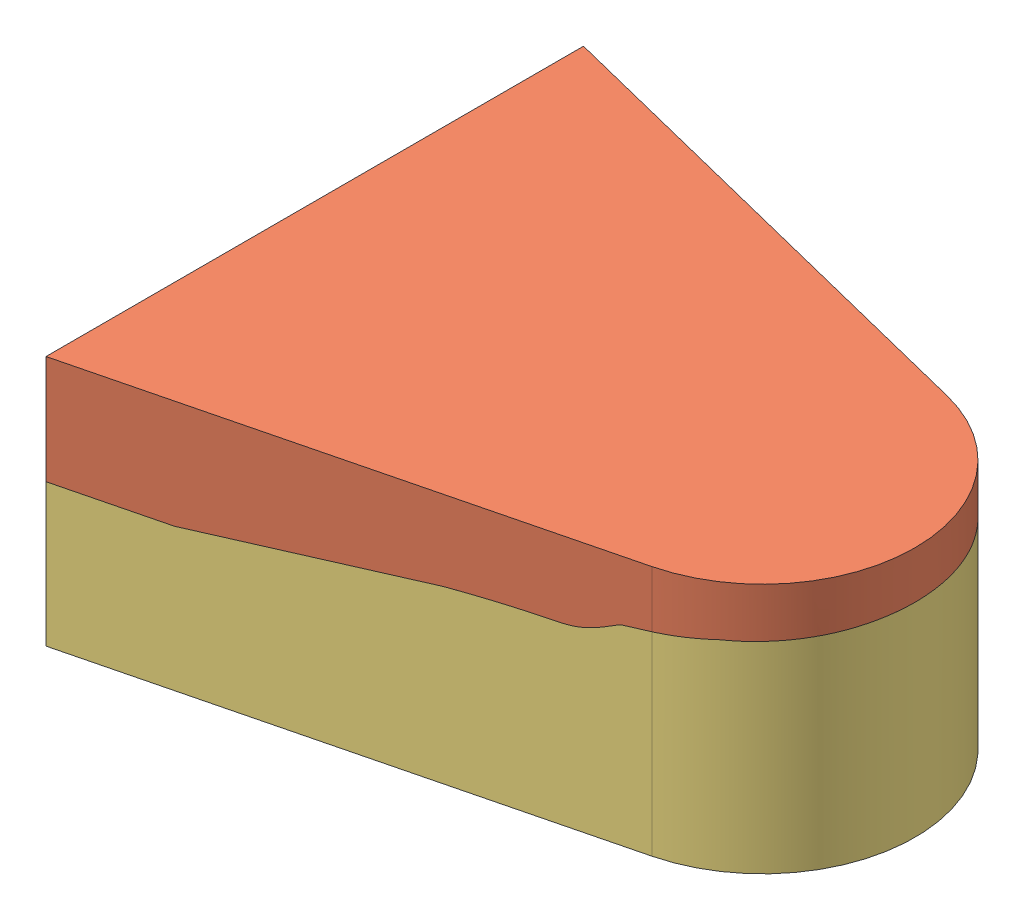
SolidWorks assembly Assem3.sldasm, configuration Default (file format 6000). Lengths in mm.
Overall size (335 140 300).
3 component instances, 3 part files, 6 mates.
Components (placement in the parent):
- Base-1: Base.sldprt [Default] at (31.723 -17.3705 334.6226) size (259.7 45.66 200.5)
- Cavity-1: Cavity.sldprt [Default] at (31.723 -217.3705 334.6226) size (335 70.13 300)
- Core-1: Core.sldprt [Default] at (31.723 182.6295 334.6226) size (335 118.46 300)
Mates (geometry in assembly coordinates):
- Coincident3: coincident anti-aligned: plane of Base-1 through (31.723 -17.3705 334.6226) normal (0 -1 0); plane of Core-1 through (31.723 -17.3705 334.6226) normal (0 1 0)
- Coincident4: coincident anti-aligned: plane of Base-1 through (290.871 8.2957 348.6226) normal (0.00659 -0.050059 0.998725); plane of Core-1 through (290.871 8.2957 348.6226) normal (-0.00659 0.050059 -0.998725)
- Coincident5: coincident anti-aligned: plane of Base-1 through (290.871 8.2957 320.6226) normal (0.130526 -0.991445 0); plane of Core-1 through (290.871 8.2957 320.6226) normal (-0.130526 0.991445 0)
- Coincident6: coincident: plane of Cavity-1 through (-18.3119 100.551 184.6226) normal (-1 0 0); plane of Core-1 through (-18.3119 -85.3705 184.6226) normal (-1 0 0)
- Coincident7: coincident: plane of Cavity-1 through (-18.3119 100.551 484.6226) normal (0.242144 0 0.97024); plane of Core-1 through (-18.3119 -85.3705 484.6226) normal (0.242144 0 0.97024)
- Coincident9: coincident aligned: line of Cavity-1 through (-18.3119 -15.3705 238.6352) axis (0 0 1); line of Core-1 through (-18.3119 -15.3705 238.6352) axis (0 0 1)
